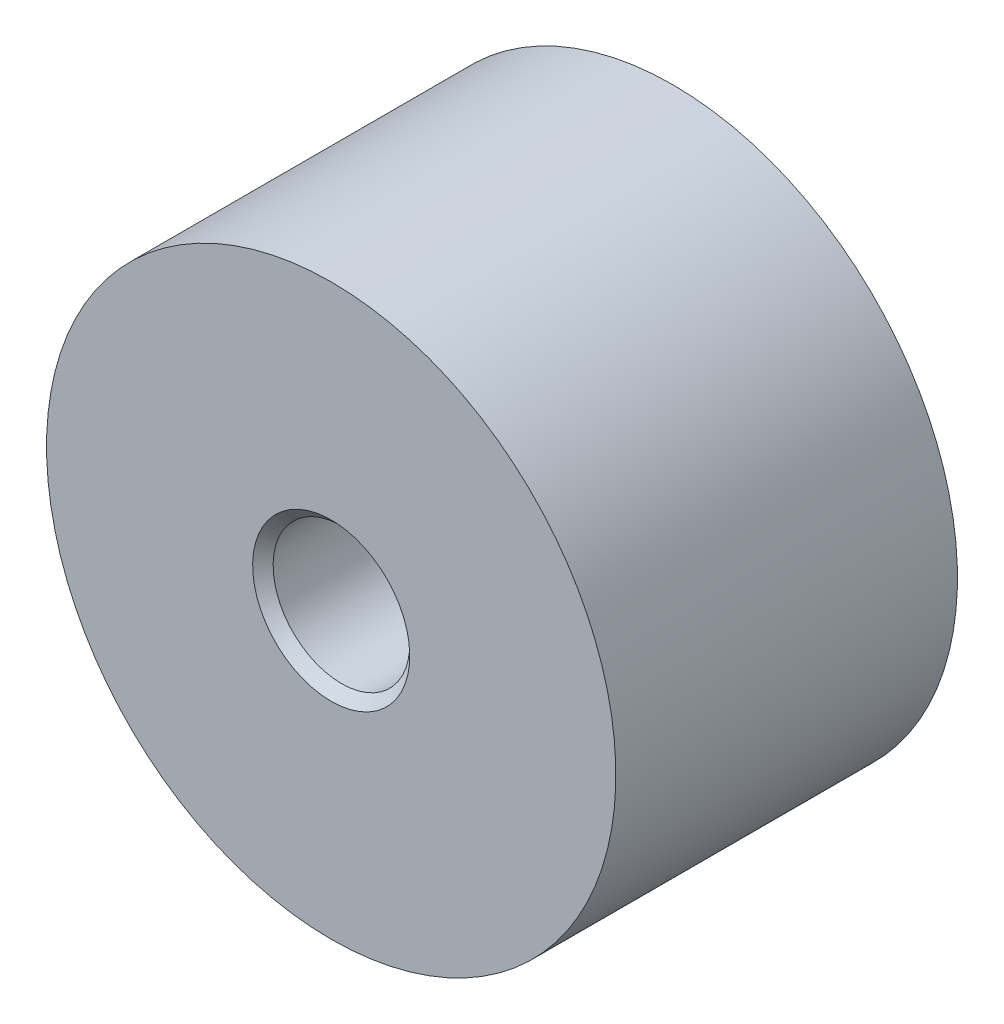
ISO-10303-21;
HEADER;
FILE_DESCRIPTION(('STEP AP214'),'2;1');
FILE_NAME('part.step','',(''),(''),'','','');
FILE_SCHEMA(('AUTOMOTIVE_DESIGN { 1 0 10303 214 1 1 1 1 }'));
ENDSEC;
DATA;
#1=APPLICATION_CONTEXT('core data for automotive mechanical design processes');
#2=APPLICATION_PROTOCOL_DEFINITION('international standard','automotive_design',2000,#1);
#3=PRODUCT_CONTEXT('',#1,'mechanical');
#4=PRODUCT('Part','Part','',(#3));
#5=PRODUCT_RELATED_PRODUCT_CATEGORY('part','',(#4));
#6=PRODUCT_DEFINITION_FORMATION('','',#4);
#7=PRODUCT_DEFINITION_CONTEXT('part definition',#1,'design');
#8=PRODUCT_DEFINITION('design','',#6,#7);
#9=PRODUCT_DEFINITION_SHAPE('','',#8);
#10=(LENGTH_UNIT() NAMED_UNIT(*) SI_UNIT(.MILLI.,.METRE.));
#11=(NAMED_UNIT(*) PLANE_ANGLE_UNIT() SI_UNIT($,.RADIAN.));
#12=(NAMED_UNIT(*) SI_UNIT($,.STERADIAN.) SOLID_ANGLE_UNIT());
#13=UNCERTAINTY_MEASURE_WITH_UNIT(LENGTH_MEASURE(1.E-05),#10,'distance_accuracy_value','');
#14=(GEOMETRIC_REPRESENTATION_CONTEXT(3) GLOBAL_UNCERTAINTY_ASSIGNED_CONTEXT((#13)) GLOBAL_UNIT_ASSIGNED_CONTEXT((#10,
#11,#12)) REPRESENTATION_CONTEXT('',''));
#15=CARTESIAN_POINT('',(0.,0.,0.));
#16=DIRECTION('',(0.,0.,1.));
#17=DIRECTION('',(1.,0.,0.));
#18=AXIS2_PLACEMENT_3D('',#15,#16,#17);
#19=CARTESIAN_POINT('',(11.666666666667,0.,15.));
#20=DIRECTION('',(0.,0.,1.));
#21=DIRECTION('',(0.,-1.,0.));
#22=AXIS2_PLACEMENT_3D('',#19,#20,#21);
#23=PLANE('',#22);
#24=CARTESIAN_POINT('',(0.,0.,15.));
#25=DIRECTION('',(0.,0.,1.));
#26=DIRECTION('',(0.,-1.,0.));
#27=AXIS2_PLACEMENT_3D('',#24,#25,#26);
#28=CIRCLE('',#27,3.45);
#29=CARTESIAN_POINT('',(0.,-3.45,15.));
#30=VERTEX_POINT('',#29);
#31=EDGE_CURVE('E8',#30,#30,#28,.F.);
#32=ORIENTED_EDGE('',*,*,#31,.T.);
#33=EDGE_LOOP('',(#32));
#34=FACE_BOUND('',#33,.T.);
#35=CARTESIAN_POINT('',(0.,0.,15.));
#36=DIRECTION('',(0.,0.,1.));
#37=DIRECTION('',(0.,-1.,0.));
#38=AXIS2_PLACEMENT_3D('',#35,#36,#37);
#39=CIRCLE('',#38,12.5);
#40=CARTESIAN_POINT('',(0.,-12.5,15.));
#41=VERTEX_POINT('',#40);
#42=EDGE_CURVE('E23',#41,#41,#39,.T.);
#43=ORIENTED_EDGE('',*,*,#42,.T.);
#44=EDGE_LOOP('',(#43));
#45=FACE_BOUND('',#44,.T.);
#46=ADVANCED_FACE('F12',(#34,#45),#23,.T.);
#47=CARTESIAN_POINT('',(0.,0.,0.));
#48=DIRECTION('',(0.,0.,1.));
#49=DIRECTION('',(0.,-1.,0.));
#50=AXIS2_PLACEMENT_3D('',#47,#48,#49);
#51=CYLINDRICAL_SURFACE('',#50,12.5);
#52=CARTESIAN_POINT('',(0.,0.,0.));
#53=DIRECTION('',(0.,0.,1.));
#54=DIRECTION('',(0.,-1.,0.));
#55=AXIS2_PLACEMENT_3D('',#52,#53,#54);
#56=CIRCLE('',#55,12.5);
#57=CARTESIAN_POINT('',(0.,-12.5,0.));
#58=VERTEX_POINT('',#57);
#59=EDGE_CURVE('E27',#58,#58,#56,.T.);
#60=ORIENTED_EDGE('',*,*,#59,.T.);
#61=EDGE_LOOP('',(#60));
#62=FACE_BOUND('',#61,.T.);
#63=ORIENTED_EDGE('',*,*,#42,.F.);
#64=EDGE_LOOP('',(#63));
#65=FACE_BOUND('',#64,.T.);
#66=ADVANCED_FACE('F48',(#62,#65),#51,.T.);
#67=CARTESIAN_POINT('',(12.5,0.,0.));
#68=DIRECTION('',(0.,0.,-1.));
#69=DIRECTION('',(0.,1.,0.));
#70=AXIS2_PLACEMENT_3D('',#67,#68,#69);
#71=PLANE('',#70);
#72=ORIENTED_EDGE('',*,*,#59,.F.);
#73=EDGE_LOOP('',(#72));
#74=FACE_BOUND('',#73,.T.);
#75=ADVANCED_FACE('F40',(#74),#71,.T.);
#76=CARTESIAN_POINT('',(0.,0.,11.));
#77=DIRECTION('',(0.,0.,1.));
#78=DIRECTION('',(0.,-1.,0.));
#79=AXIS2_PLACEMENT_3D('',#76,#77,#78);
#80=CYLINDRICAL_SURFACE('',#79,3.);
#81=CARTESIAN_POINT('',(0.,0.,14.55));
#82=DIRECTION('',(0.,0.,1.));
#83=DIRECTION('',(0.,-1.,0.));
#84=AXIS2_PLACEMENT_3D('',#81,#82,#83);
#85=CIRCLE('',#84,3.);
#86=CARTESIAN_POINT('',(0.,-3.,14.55));
#87=VERTEX_POINT('',#86);
#88=EDGE_CURVE('E19',#87,#87,#85,.T.);
#89=ORIENTED_EDGE('',*,*,#88,.T.);
#90=EDGE_LOOP('',(#89));
#91=FACE_BOUND('',#90,.T.);
#92=CARTESIAN_POINT('',(0.,0.,9.));
#93=DIRECTION('',(0.,0.,1.));
#94=DIRECTION('',(0.,-1.,0.));
#95=AXIS2_PLACEMENT_3D('',#92,#93,#94);
#96=CIRCLE('',#95,3.);
#97=CARTESIAN_POINT('',(0.,-3.,9.));
#98=VERTEX_POINT('',#97);
#99=EDGE_CURVE('E32',#98,#98,#96,.T.);
#100=ORIENTED_EDGE('',*,*,#99,.F.);
#101=EDGE_LOOP('',(#100));
#102=FACE_BOUND('',#101,.T.);
#103=ADVANCED_FACE('F38',(#91,#102),#80,.F.);
#104=CARTESIAN_POINT('',(0.,0.,9.));
#105=DIRECTION('',(0.,0.,1.));
#106=DIRECTION('',(0.,-1.,0.));
#107=AXIS2_PLACEMENT_3D('',#104,#105,#106);
#108=PLANE('',#107);
#109=ORIENTED_EDGE('',*,*,#99,.T.);
#110=EDGE_LOOP('',(#109));
#111=FACE_BOUND('',#110,.T.);
#112=ADVANCED_FACE('F36',(#111),#108,.T.);
#113=CARTESIAN_POINT('',(0.,0.,14.55));
#114=DIRECTION('',(0.,0.,1.));
#115=DIRECTION('',(0.,-1.,0.));
#116=AXIS2_PLACEMENT_3D('',#113,#114,#115);
#117=CONICAL_SURFACE('',#116,3.,0.785398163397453);
#118=ORIENTED_EDGE('',*,*,#31,.F.);
#119=EDGE_LOOP('',(#118));
#120=FACE_BOUND('',#119,.T.);
#121=ORIENTED_EDGE('',*,*,#88,.F.);
#122=EDGE_LOOP('',(#121));
#123=FACE_BOUND('',#122,.T.);
#124=ADVANCED_FACE('F14',(#120,#123),#117,.F.);
#125=CLOSED_SHELL('',(#46,#66,#75,#103,#112,#124));
#126=MANIFOLD_SOLID_BREP('B1',#125);
#127=ADVANCED_BREP_SHAPE_REPRESENTATION('',(#18,#126),#14);
#128=SHAPE_DEFINITION_REPRESENTATION(#9,#127);
ENDSEC;
END-ISO-10303-21;
